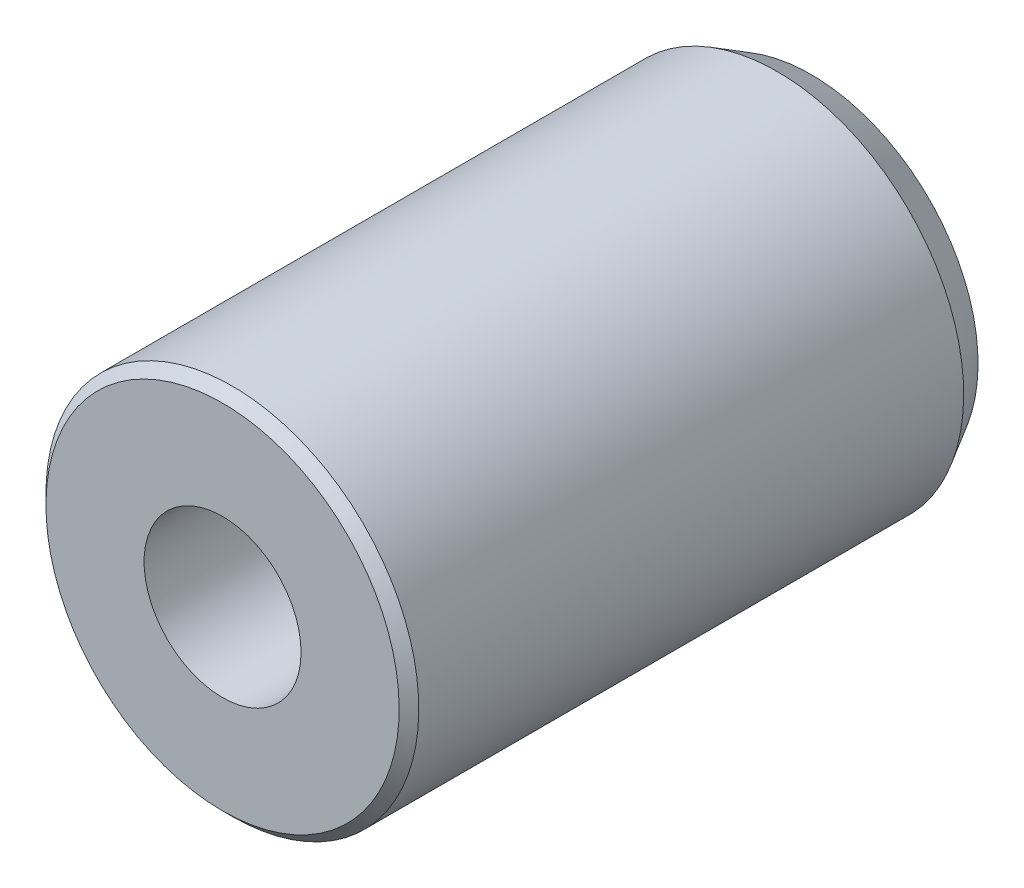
ISO-10303-21;
HEADER;
FILE_DESCRIPTION(('STEP AP214'),'2;1');
FILE_NAME('part.step','',(''),(''),'','','');
FILE_SCHEMA(('AUTOMOTIVE_DESIGN { 1 0 10303 214 1 1 1 1 }'));
ENDSEC;
DATA;
#1=APPLICATION_CONTEXT('core data for automotive mechanical design processes');
#2=APPLICATION_PROTOCOL_DEFINITION('international standard','automotive_design',2000,#1);
#3=PRODUCT_CONTEXT('',#1,'mechanical');
#4=PRODUCT('Part','Part','',(#3));
#5=PRODUCT_RELATED_PRODUCT_CATEGORY('part','',(#4));
#6=PRODUCT_DEFINITION_FORMATION('','',#4);
#7=PRODUCT_DEFINITION_CONTEXT('part definition',#1,'design');
#8=PRODUCT_DEFINITION('design','',#6,#7);
#9=PRODUCT_DEFINITION_SHAPE('','',#8);
#10=(LENGTH_UNIT() NAMED_UNIT(*) SI_UNIT(.MILLI.,.METRE.));
#11=(NAMED_UNIT(*) PLANE_ANGLE_UNIT() SI_UNIT($,.RADIAN.));
#12=(NAMED_UNIT(*) SI_UNIT($,.STERADIAN.) SOLID_ANGLE_UNIT());
#13=UNCERTAINTY_MEASURE_WITH_UNIT(LENGTH_MEASURE(1.E-05),#10,'distance_accuracy_value','');
#14=(GEOMETRIC_REPRESENTATION_CONTEXT(3) GLOBAL_UNCERTAINTY_ASSIGNED_CONTEXT((#13)) GLOBAL_UNIT_ASSIGNED_CONTEXT((#10,
#11,#12)) REPRESENTATION_CONTEXT('',''));
#15=CARTESIAN_POINT('',(0.,0.,0.));
#16=DIRECTION('',(0.,0.,1.));
#17=DIRECTION('',(1.,0.,0.));
#18=AXIS2_PLACEMENT_3D('',#15,#16,#17);
#19=CARTESIAN_POINT('',(0.,0.,30.));
#20=DIRECTION('',(0.,0.,1.));
#21=DIRECTION('',(0.,-1.,0.));
#22=AXIS2_PLACEMENT_3D('',#19,#20,#21);
#23=PLANE('',#22);
#24=CARTESIAN_POINT('',(0.,0.,30.));
#25=DIRECTION('',(0.,0.,1.));
#26=DIRECTION('',(0.,-1.,0.));
#27=AXIS2_PLACEMENT_3D('',#24,#25,#26);
#28=CIRCLE('',#27,9.);
#29=CARTESIAN_POINT('',(0.,-9.,30.));
#30=VERTEX_POINT('',#29);
#31=EDGE_CURVE('E28',#30,#30,#28,.T.);
#32=ORIENTED_EDGE('',*,*,#31,.T.);
#33=EDGE_LOOP('',(#32));
#34=FACE_BOUND('',#33,.T.);
#35=CARTESIAN_POINT('',(0.,0.,30.));
#36=DIRECTION('',(0.,0.,1.));
#37=DIRECTION('',(1.,0.,0.));
#38=AXIS2_PLACEMENT_3D('',#35,#36,#37);
#39=CIRCLE('',#38,4.);
#40=CARTESIAN_POINT('',(4.,0.,30.));
#41=VERTEX_POINT('',#40);
#42=EDGE_CURVE('E36',#41,#41,#39,.T.);
#43=ORIENTED_EDGE('',*,*,#42,.F.);
#44=EDGE_LOOP('',(#43));
#45=FACE_BOUND('',#44,.T.);
#46=ADVANCED_FACE('F13',(#34,#45),#23,.T.);
#47=CARTESIAN_POINT('',(0.,0.,0.));
#48=DIRECTION('',(0.,0.,1.));
#49=DIRECTION('',(0.,-1.,0.));
#50=AXIS2_PLACEMENT_3D('',#47,#48,#49);
#51=PLANE('',#50);
#52=CARTESIAN_POINT('',(0.,0.,0.));
#53=DIRECTION('',(0.,0.,1.));
#54=DIRECTION('',(0.,-1.,0.));
#55=AXIS2_PLACEMENT_3D('',#52,#53,#54);
#56=CIRCLE('',#55,8.5);
#57=CARTESIAN_POINT('',(0.,-8.5,0.));
#58=VERTEX_POINT('',#57);
#59=EDGE_CURVE('E8',#58,#58,#56,.F.);
#60=ORIENTED_EDGE('',*,*,#59,.T.);
#61=EDGE_LOOP('',(#60));
#62=FACE_BOUND('',#61,.T.);
#63=CARTESIAN_POINT('',(0.,0.,0.));
#64=DIRECTION('',(0.,0.,1.));
#65=DIRECTION('',(0.,-1.,0.));
#66=AXIS2_PLACEMENT_3D('',#63,#64,#65);
#67=CIRCLE('',#66,4.);
#68=CARTESIAN_POINT('',(0.,-4.,0.));
#69=VERTEX_POINT('',#68);
#70=EDGE_CURVE('E33',#69,#69,#67,.F.);
#71=ORIENTED_EDGE('',*,*,#70,.F.);
#72=EDGE_LOOP('',(#71));
#73=FACE_BOUND('',#72,.T.);
#74=ADVANCED_FACE('F44',(#62,#73),#51,.F.);
#75=CARTESIAN_POINT('',(0.,0.,30.));
#76=DIRECTION('',(0.,0.,-1.));
#77=DIRECTION('',(0.,1.,0.));
#78=AXIS2_PLACEMENT_3D('',#75,#76,#77);
#79=CYLINDRICAL_SURFACE('',#78,9.5);
#80=CARTESIAN_POINT('',(0.,0.,1.73205080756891));
#81=DIRECTION('',(0.,0.,1.));
#82=DIRECTION('',(0.,-1.,0.));
#83=AXIS2_PLACEMENT_3D('',#80,#81,#82);
#84=CIRCLE('',#83,9.5);
#85=CARTESIAN_POINT('',(0.,-9.5,1.73205080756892));
#86=VERTEX_POINT('',#85);
#87=EDGE_CURVE('E20',#86,#86,#84,.T.);
#88=ORIENTED_EDGE('',*,*,#87,.T.);
#89=EDGE_LOOP('',(#88));
#90=FACE_BOUND('',#89,.T.);
#91=CARTESIAN_POINT('',(0.,0.,29.5));
#92=DIRECTION('',(0.,0.,1.));
#93=DIRECTION('',(0.,-1.,0.));
#94=AXIS2_PLACEMENT_3D('',#91,#92,#93);
#95=CIRCLE('',#94,9.5);
#96=CARTESIAN_POINT('',(0.,-9.5,29.5));
#97=VERTEX_POINT('',#96);
#98=EDGE_CURVE('E24',#97,#97,#95,.F.);
#99=ORIENTED_EDGE('',*,*,#98,.T.);
#100=EDGE_LOOP('',(#99));
#101=FACE_BOUND('',#100,.T.);
#102=ADVANCED_FACE('F15',(#90,#101),#79,.T.);
#103=CARTESIAN_POINT('',(0.,0.,30.));
#104=DIRECTION('',(0.,0.,1.));
#105=DIRECTION('',(1.,0.,0.));
#106=AXIS2_PLACEMENT_3D('',#103,#104,#105);
#107=CYLINDRICAL_SURFACE('',#106,4.);
#108=ORIENTED_EDGE('',*,*,#42,.T.);
#109=EDGE_LOOP('',(#108));
#110=FACE_BOUND('',#109,.T.);
#111=ORIENTED_EDGE('',*,*,#70,.T.);
#112=EDGE_LOOP('',(#111));
#113=FACE_BOUND('',#112,.T.);
#114=ADVANCED_FACE('F40',(#110,#113),#107,.F.);
#115=CARTESIAN_POINT('',(0.,0.,30.));
#116=DIRECTION('',(0.,0.,-1.));
#117=DIRECTION('',(0.,1.,0.));
#118=AXIS2_PLACEMENT_3D('',#115,#116,#117);
#119=CONICAL_SURFACE('',#118,9.,0.785398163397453);
#120=ORIENTED_EDGE('',*,*,#98,.F.);
#121=EDGE_LOOP('',(#120));
#122=FACE_BOUND('',#121,.T.);
#123=ORIENTED_EDGE('',*,*,#31,.F.);
#124=EDGE_LOOP('',(#123));
#125=FACE_BOUND('',#124,.T.);
#126=ADVANCED_FACE('F55',(#122,#125),#119,.T.);
#127=CARTESIAN_POINT('',(0.,0.,1.73205080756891));
#128=DIRECTION('',(0.,0.,1.));
#129=DIRECTION('',(0.,-1.,0.));
#130=AXIS2_PLACEMENT_3D('',#127,#128,#129);
#131=CONICAL_SURFACE('',#130,9.5,0.523598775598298);
#132=ORIENTED_EDGE('',*,*,#59,.F.);
#133=EDGE_LOOP('',(#132));
#134=FACE_BOUND('',#133,.T.);
#135=ORIENTED_EDGE('',*,*,#87,.F.);
#136=EDGE_LOOP('',(#135));
#137=FACE_BOUND('',#136,.T.);
#138=ADVANCED_FACE('F58',(#134,#137),#131,.T.);
#139=CLOSED_SHELL('',(#46,#74,#102,#114,#126,#138));
#140=MANIFOLD_SOLID_BREP('B1',#139);
#141=ADVANCED_BREP_SHAPE_REPRESENTATION('',(#18,#140),#14);
#142=SHAPE_DEFINITION_REPRESENTATION(#9,#141);
ENDSEC;
END-ISO-10303-21;
